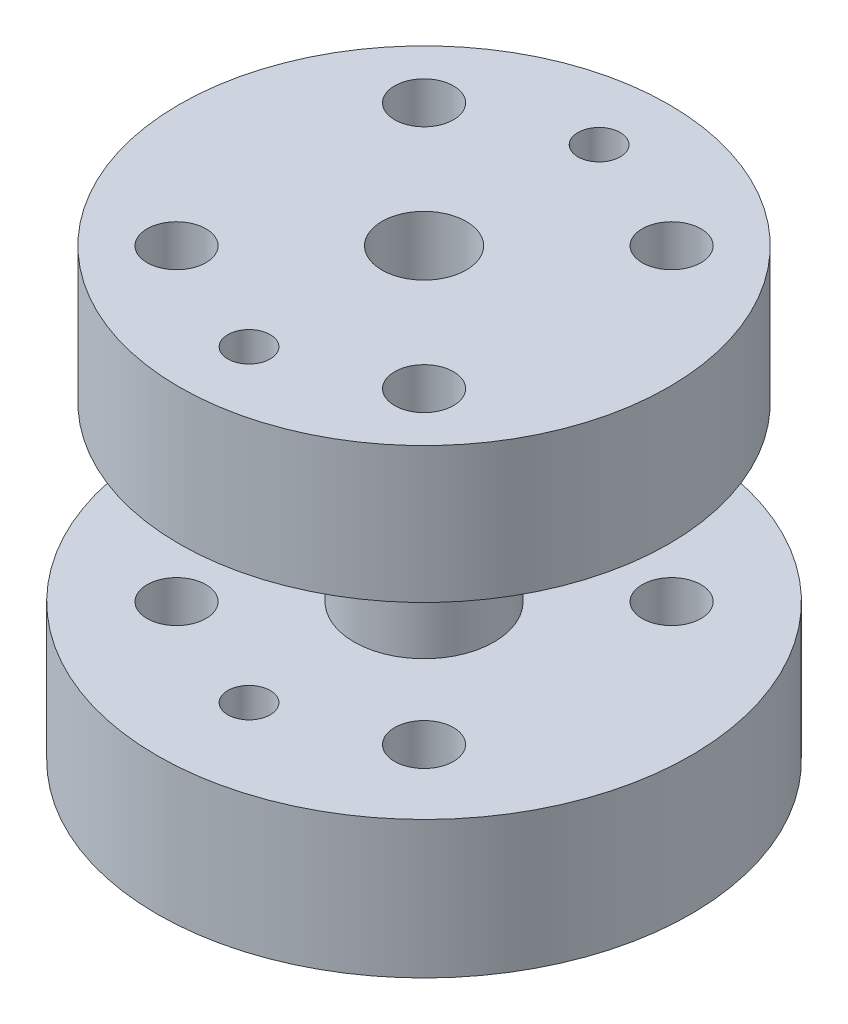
from build123d import *

# Parameters (mm, degrees)
SKETCH1_R                  = 19.05
BOSS_EXTRUDE1_DEPTH        = 9.8
SKETCH2_R                  = 5
BOSS_EXTRUDE2_DEPTH        = 12.3
SKETCH3_R                  = 17.475
BOSS_EXTRUDE3_DEPTH        = 9.7
M5X0_8_TAPPED_HOLE1_REACH  = 43.678
M5X0_8_TAPPED_HOLE1_BORE_R = 2.1
CIRPATTERN1_COUNT          = 4
SKETCH4_R                  = 1.51
CUT_EXTRUDE2_DEPTH         = 42.677871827
CIRPATTERN2_COUNT          = 2
M5X0_8_TAPPED_HOLE2_D      = 4.2
CIRPATTERN3_COUNT          = 4
SKETCH5_R                  = 3.01
CUT_EXTRUDE3_DEPTH         = 42.677871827


with BuildPart() as part:
    # Sketch1 → Boss-Extrude1 (new body)
    with BuildSketch(Plane(origin=(0, 0, 0), x_dir=(1, 0, 0), z_dir=(0, 1, 0))):
        with Locations(Location((0, 0, 0), (0, 0, 270))):
            Circle(SKETCH1_R)
    extrude(amount=BOSS_EXTRUDE1_DEPTH)

    # Sketch2 → Boss-Extrude2 (add)
    with BuildSketch(Plane(origin=(0, 9.8, 0), x_dir=(1, 0, 0), z_dir=(0, 1, 0))):
        with Locations(Location((0, 0, 0), (0, 0, 270))):
            Circle(SKETCH2_R)
    extrude(amount=BOSS_EXTRUDE2_DEPTH)

    # Sketch3 → Boss-Extrude3 (add)
    with BuildSketch(Plane(origin=(0, 22.1, 0), x_dir=(1, 0, 0), z_dir=(0, 1, 0))):
        with Locations(Location((0, 0, 0), (0, 0, 270))):
            Circle(SKETCH3_R)
    extrude(amount=BOSS_EXTRUDE3_DEPTH)

    # M5x0.8 Tapped Hole1 bore → M5x0.8 Tapped Hole1 (cut, up to next)
    with BuildSketch(Plane(origin=(0, 31.8, 0), x_dir=(-1, 0, 0), z_dir=(0, 1, 0)), mode=Mode.PRIVATE) as m5x0_8_tapped_hole1_sk1:
        with Locations((-8.8353, -8.835298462)):
            Circle(M5X0_8_TAPPED_HOLE1_BORE_R)
    m5x0_8_tapped_hole1_tool1 = extrude(m5x0_8_tapped_hole1_sk1.sketch, amount=-M5X0_8_TAPPED_HOLE1_REACH, mode=Mode.PRIVATE) & part.part
    m5x0_8_tapped_hole1 = m5x0_8_tapped_hole1_tool1.solids().sort_by_distance((8.8353, 31.8, -8.835298))[0]
    add(m5x0_8_tapped_hole1, mode=Mode.SUBTRACT)

    # CirPattern1: M5x0.8 Tapped Hole1 ×4 about axis
    cirpattern1_axis = Axis((0, 0, 0), (0, 1, 0))
    for i in range(1, CIRPATTERN1_COUNT):
        add(m5x0_8_tapped_hole1.rotate(cirpattern1_axis, i * 360 / CIRPATTERN1_COUNT), mode=Mode.SUBTRACT)

    # Sketch4 → Cut-Extrude2 (cut, through all)
    with BuildSketch(Plane(origin=(0, 31.8, 0), x_dir=(-1, 0, 0), z_dir=(0, 1, 0))):
        with Locations(Location((0, -12.495, 0), (0, 0, 90))):
            Circle(SKETCH4_R)
    cut_extrude2 = extrude(amount=-CUT_EXTRUDE2_DEPTH, mode=Mode.SUBTRACT)

    # CirPattern2: Cut-Extrude2 ×2 about axis
    cirpattern2_axis = Axis((0, 0, 0), (0, 1, 0))
    for i in range(1, CIRPATTERN2_COUNT):
        add(cut_extrude2.rotate(cirpattern2_axis, i * 360 / CIRPATTERN2_COUNT), mode=Mode.SUBTRACT)

    # M5x0.8 Tapped Hole2 (through all)
    with Locations(Plane.XZ):
        with Locations((8.8353, 8.835298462)):
            m5x0_8_tapped_hole2 = Hole(M5X0_8_TAPPED_HOLE2_D / 2)

    # CirPattern3: M5x0.8 Tapped Hole2 ×4 about axis
    cirpattern3_axis = Axis((0, 0, 0), (0, 1, 0))
    for i in range(1, CIRPATTERN3_COUNT):
        add(m5x0_8_tapped_hole2.rotate(cirpattern3_axis, i * 360 / CIRPATTERN3_COUNT), mode=Mode.SUBTRACT)

    # Sketch5 → Cut-Extrude3 (cut, through all)
    with BuildSketch(Plane(origin=(0, 31.8, 0), x_dir=(-1, 0, 0), z_dir=(0, 1, 0))):
        with Locations(Location((0, 0, 0), (0, 0, 90))):
            Circle(SKETCH5_R)
    extrude(amount=-CUT_EXTRUDE3_DEPTH, mode=Mode.SUBTRACT)


solid = part.part
